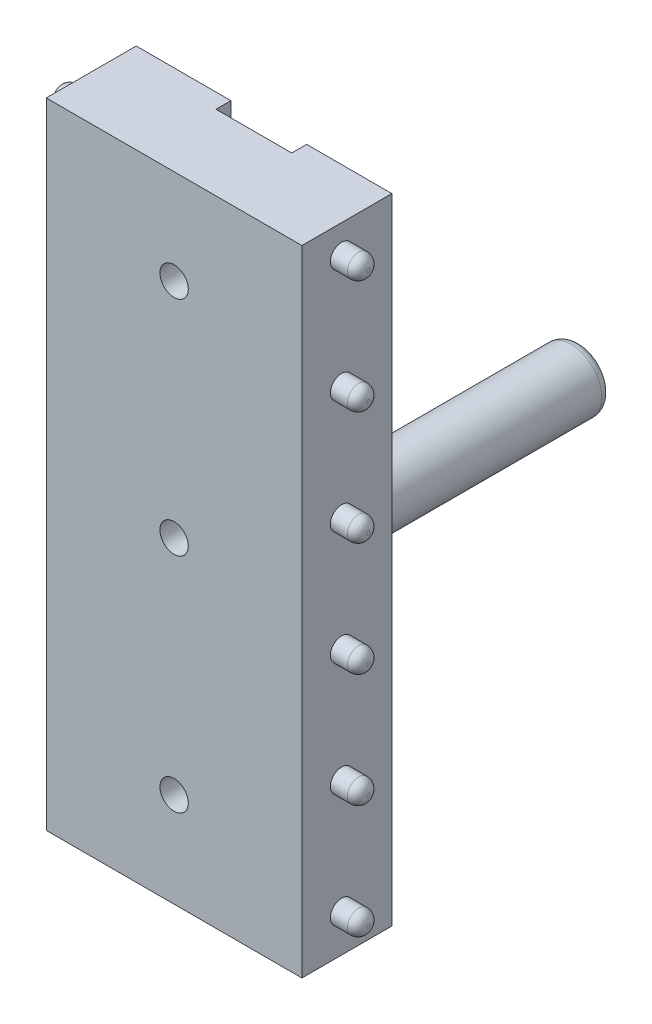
ISO-10303-21;
HEADER;
FILE_DESCRIPTION(('STEP AP214'),'2;1');
FILE_NAME('part.step','',(''),(''),'','','');
FILE_SCHEMA(('AUTOMOTIVE_DESIGN { 1 0 10303 214 1 1 1 1 }'));
ENDSEC;
DATA;
#1=APPLICATION_CONTEXT('core data for automotive mechanical design processes');
#2=APPLICATION_PROTOCOL_DEFINITION('international standard','automotive_design',2000,#1);
#3=PRODUCT_CONTEXT('',#1,'mechanical');
#4=PRODUCT('Part','Part','',(#3));
#5=PRODUCT_RELATED_PRODUCT_CATEGORY('part','',(#4));
#6=PRODUCT_DEFINITION_FORMATION('','',#4);
#7=PRODUCT_DEFINITION_CONTEXT('part definition',#1,'design');
#8=PRODUCT_DEFINITION('design','',#6,#7);
#9=PRODUCT_DEFINITION_SHAPE('','',#8);
#10=(LENGTH_UNIT() NAMED_UNIT(*) SI_UNIT(.MILLI.,.METRE.));
#11=(NAMED_UNIT(*) PLANE_ANGLE_UNIT() SI_UNIT($,.RADIAN.));
#12=(NAMED_UNIT(*) SI_UNIT($,.STERADIAN.) SOLID_ANGLE_UNIT());
#13=UNCERTAINTY_MEASURE_WITH_UNIT(LENGTH_MEASURE(1.E-05),#10,'distance_accuracy_value','');
#14=(GEOMETRIC_REPRESENTATION_CONTEXT(3) GLOBAL_UNCERTAINTY_ASSIGNED_CONTEXT((#13)) GLOBAL_UNIT_ASSIGNED_CONTEXT((#10,
#11,#12)) REPRESENTATION_CONTEXT('',''));
#15=CARTESIAN_POINT('',(0.,0.,0.));
#16=DIRECTION('',(0.,0.,1.));
#17=DIRECTION('',(1.,0.,0.));
#18=AXIS2_PLACEMENT_3D('',#15,#16,#17);
#19=CARTESIAN_POINT('',(27.,67.,0.));
#20=DIRECTION('',(-1.,0.,0.));
#21=DIRECTION('',(0.,0.,1.));
#22=AXIS2_PLACEMENT_3D('',#19,#20,#21);
#23=PLANE('',#22);
#24=CARTESIAN_POINT('',(27.,16.,-4.2000000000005));
#25=DIRECTION('',(-1.,0.,0.));
#26=DIRECTION('',(0.,0.,1.));
#27=AXIS2_PLACEMENT_3D('',#24,#25,#26);
#28=CIRCLE('',#27,1.2);
#29=CARTESIAN_POINT('',(27.,16.,-3.0000000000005));
#30=VERTEX_POINT('',#29);
#31=EDGE_CURVE('E176',#30,#30,#28,.F.);
#32=ORIENTED_EDGE('',*,*,#31,.F.);
#33=EDGE_LOOP('',(#32));
#34=FACE_BOUND('',#33,.T.);
#35=CARTESIAN_POINT('',(27.,40.,-4.20000000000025));
#36=DIRECTION('',(-1.,0.,0.));
#37=DIRECTION('',(0.,0.,1.));
#38=AXIS2_PLACEMENT_3D('',#35,#36,#37);
#39=CIRCLE('',#38,1.2);
#40=CARTESIAN_POINT('',(27.,40.,-3.00000000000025));
#41=VERTEX_POINT('',#40);
#42=EDGE_CURVE('E170',#41,#41,#39,.F.);
#43=ORIENTED_EDGE('',*,*,#42,.F.);
#44=EDGE_LOOP('',(#43));
#45=FACE_BOUND('',#44,.T.);
#46=CARTESIAN_POINT('',(27.,64.,-4.2));
#47=DIRECTION('',(-1.,0.,0.));
#48=DIRECTION('',(0.,0.,1.));
#49=AXIS2_PLACEMENT_3D('',#46,#47,#48);
#50=CIRCLE('',#49,1.2);
#51=CARTESIAN_POINT('',(27.,64.,-3.));
#52=VERTEX_POINT('',#51);
#53=EDGE_CURVE('E164',#52,#52,#50,.F.);
#54=ORIENTED_EDGE('',*,*,#53,.F.);
#55=EDGE_LOOP('',(#54));
#56=FACE_BOUND('',#55,.T.);
#57=DIRECTION('',(0.,0.,-1.));
#58=VECTOR('',#57,1.);
#59=CARTESIAN_POINT('',(27.,0.,0.));
#60=LINE('',#59,#58);
#61=CARTESIAN_POINT('',(27.,0.,0.));
#62=VERTEX_POINT('',#61);
#63=CARTESIAN_POINT('',(27.,0.,-9.5));
#64=VERTEX_POINT('',#63);
#65=EDGE_CURVE('E98',#62,#64,#60,.T.);
#66=ORIENTED_EDGE('',*,*,#65,.T.);
#67=DIRECTION('',(0.,-1.,0.));
#68=VECTOR('',#67,1.);
#69=CARTESIAN_POINT('',(27.,67.,-9.5));
#70=LINE('',#69,#68);
#71=CARTESIAN_POINT('',(27.,67.,-9.5));
#72=VERTEX_POINT('',#71);
#73=EDGE_CURVE('E158',#72,#64,#70,.T.);
#74=ORIENTED_EDGE('',*,*,#73,.F.);
#75=DIRECTION('',(0.,0.,-1.));
#76=VECTOR('',#75,1.);
#77=CARTESIAN_POINT('',(27.,67.,0.));
#78=LINE('',#77,#76);
#79=CARTESIAN_POINT('',(27.,67.,0.));
#80=VERTEX_POINT('',#79);
#81=EDGE_CURVE('E135',#80,#72,#78,.T.);
#82=ORIENTED_EDGE('',*,*,#81,.F.);
#83=DIRECTION('',(0.,-1.,0.));
#84=VECTOR('',#83,1.);
#85=CARTESIAN_POINT('',(27.,67.,0.));
#86=LINE('',#85,#84);
#87=EDGE_CURVE('E110',#80,#62,#86,.T.);
#88=ORIENTED_EDGE('',*,*,#87,.T.);
#89=EDGE_LOOP('',(#66,#74,#82,#88));
#90=FACE_BOUND('',#89,.T.);
#91=CARTESIAN_POINT('',(27.,52.,-4.20000000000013));
#92=DIRECTION('',(-1.,0.,0.));
#93=DIRECTION('',(0.,0.,1.));
#94=AXIS2_PLACEMENT_3D('',#91,#92,#93);
#95=CIRCLE('',#94,1.2);
#96=CARTESIAN_POINT('',(27.,52.,-3.00000000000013));
#97=VERTEX_POINT('',#96);
#98=EDGE_CURVE('E167',#97,#97,#95,.F.);
#99=ORIENTED_EDGE('',*,*,#98,.F.);
#100=EDGE_LOOP('',(#99));
#101=FACE_BOUND('',#100,.T.);
#102=CARTESIAN_POINT('',(27.,28.,-4.20000000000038));
#103=DIRECTION('',(-1.,0.,0.));
#104=DIRECTION('',(0.,0.,1.));
#105=AXIS2_PLACEMENT_3D('',#102,#103,#104);
#106=CIRCLE('',#105,1.2);
#107=CARTESIAN_POINT('',(27.,28.,-3.00000000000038));
#108=VERTEX_POINT('',#107);
#109=EDGE_CURVE('E173',#108,#108,#106,.F.);
#110=ORIENTED_EDGE('',*,*,#109,.F.);
#111=EDGE_LOOP('',(#110));
#112=FACE_BOUND('',#111,.T.);
#113=CARTESIAN_POINT('',(27.,4.00000000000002,-4.20000000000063));
#114=DIRECTION('',(-1.,0.,0.));
#115=DIRECTION('',(0.,0.,1.));
#116=AXIS2_PLACEMENT_3D('',#113,#114,#115);
#117=CIRCLE('',#116,1.2);
#118=CARTESIAN_POINT('',(27.,4.00000000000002,-3.00000000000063));
#119=VERTEX_POINT('',#118);
#120=EDGE_CURVE('E179',#119,#119,#117,.F.);
#121=ORIENTED_EDGE('',*,*,#120,.F.);
#122=EDGE_LOOP('',(#121));
#123=FACE_BOUND('',#122,.T.);
#124=ADVANCED_FACE('F26',(#34,#45,#56,#90,#101,#112,#123),#23,.F.);
#125=CARTESIAN_POINT('',(18.,67.,-7.92807947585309));
#126=DIRECTION('',(0.,0.,1.));
#127=DIRECTION('',(1.,0.,0.));
#128=AXIS2_PLACEMENT_3D('',#125,#126,#127);
#129=PLANE('',#128);
#130=CARTESIAN_POINT('',(13.5,33.5,-7.92807947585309));
#131=DIRECTION('',(0.,0.,1.));
#132=DIRECTION('',(1.,0.,0.));
#133=AXIS2_PLACEMENT_3D('',#130,#131,#132);
#134=CIRCLE('',#133,1.5);
#135=CARTESIAN_POINT('',(15.,33.5,-7.92807947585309));
#136=VERTEX_POINT('',#135);
#137=EDGE_CURVE('E724',#136,#136,#134,.T.);
#138=ORIENTED_EDGE('',*,*,#137,.T.);
#139=EDGE_LOOP('',(#138));
#140=FACE_BOUND('',#139,.T.);
#141=CARTESIAN_POINT('',(13.5,10.,-7.92807947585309));
#142=DIRECTION('',(0.,0.,1.));
#143=DIRECTION('',(1.,0.,0.));
#144=AXIS2_PLACEMENT_3D('',#141,#142,#143);
#145=CIRCLE('',#144,1.5);
#146=CARTESIAN_POINT('',(15.,10.,-7.92807947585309));
#147=VERTEX_POINT('',#146);
#148=EDGE_CURVE('E313',#147,#147,#145,.T.);
#149=ORIENTED_EDGE('',*,*,#148,.T.);
#150=EDGE_LOOP('',(#149));
#151=FACE_BOUND('',#150,.T.);
#152=CARTESIAN_POINT('',(13.5,57.,-7.92807947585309));
#153=DIRECTION('',(0.,0.,1.));
#154=DIRECTION('',(1.,0.,0.));
#155=AXIS2_PLACEMENT_3D('',#152,#153,#154);
#156=CIRCLE('',#155,1.5);
#157=CARTESIAN_POINT('',(15.,57.,-7.92807947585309));
#158=VERTEX_POINT('',#157);
#159=EDGE_CURVE('E312',#158,#158,#156,.T.);
#160=ORIENTED_EDGE('',*,*,#159,.T.);
#161=EDGE_LOOP('',(#160));
#162=FACE_BOUND('',#161,.T.);
#163=DIRECTION('',(-1.,0.,0.));
#164=VECTOR('',#163,1.);
#165=CARTESIAN_POINT('',(18.,0.,-7.92807947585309));
#166=LINE('',#165,#164);
#167=CARTESIAN_POINT('',(18.,0.,-7.92807947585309));
#168=VERTEX_POINT('',#167);
#169=CARTESIAN_POINT('',(10.,0.,-7.92807947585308));
#170=VERTEX_POINT('',#169);
#171=EDGE_CURVE('E126',#168,#170,#166,.T.);
#172=ORIENTED_EDGE('',*,*,#171,.T.);
#173=DIRECTION('',(0.,-1.,0.));
#174=VECTOR('',#173,1.);
#175=CARTESIAN_POINT('',(10.,67.,-7.92807947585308));
#176=LINE('',#175,#174);
#177=CARTESIAN_POINT('',(10.,67.,-7.92807947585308));
#178=VERTEX_POINT('',#177);
#179=EDGE_CURVE('E149',#178,#170,#176,.T.);
#180=ORIENTED_EDGE('',*,*,#179,.F.);
#181=DIRECTION('',(-1.,0.,0.));
#182=VECTOR('',#181,1.);
#183=CARTESIAN_POINT('',(18.,67.,-7.92807947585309));
#184=LINE('',#183,#182);
#185=CARTESIAN_POINT('',(18.,67.,-7.92807947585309));
#186=VERTEX_POINT('',#185);
#187=EDGE_CURVE('E141',#186,#178,#184,.T.);
#188=ORIENTED_EDGE('',*,*,#187,.F.);
#189=DIRECTION('',(0.,-1.,0.));
#190=VECTOR('',#189,1.);
#191=CARTESIAN_POINT('',(18.,67.,-7.92807947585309));
#192=LINE('',#191,#190);
#193=EDGE_CURVE('E152',#186,#168,#192,.T.);
#194=ORIENTED_EDGE('',*,*,#193,.T.);
#195=EDGE_LOOP('',(#172,#180,#188,#194));
#196=FACE_BOUND('',#195,.T.);
#197=CARTESIAN_POINT('',(13.5,27.,-7.92807947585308));
#198=DIRECTION('',(0.,0.,1.));
#199=DIRECTION('',(1.,0.,0.));
#200=AXIS2_PLACEMENT_3D('',#197,#198,#199);
#201=CIRCLE('',#200,3.25);
#202=CARTESIAN_POINT('',(16.75,27.,-7.92807947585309));
#203=VERTEX_POINT('',#202);
#204=EDGE_CURVE('E109',#203,#203,#201,.F.);
#205=ORIENTED_EDGE('',*,*,#204,.F.);
#206=EDGE_LOOP('',(#205));
#207=FACE_BOUND('',#206,.T.);
#208=ADVANCED_FACE('F278',(#140,#151,#162,#196,#207),#129,.F.);
#209=CARTESIAN_POINT('',(0.,67.,0.));
#210=DIRECTION('',(1.,0.,0.));
#211=DIRECTION('',(0.,0.,-1.));
#212=AXIS2_PLACEMENT_3D('',#209,#210,#211);
#213=PLANE('',#212);
#214=CARTESIAN_POINT('',(0.,4.00000000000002,-4.20000000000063));
#215=DIRECTION('',(1.,0.,0.));
#216=DIRECTION('',(0.,0.,-1.));
#217=AXIS2_PLACEMENT_3D('',#214,#215,#216);
#218=CIRCLE('',#217,1.2);
#219=CARTESIAN_POINT('',(0.,4.00000000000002,-5.40000000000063));
#220=VERTEX_POINT('',#219);
#221=EDGE_CURVE('E316',#220,#220,#218,.T.);
#222=ORIENTED_EDGE('',*,*,#221,.T.);
#223=EDGE_LOOP('',(#222));
#224=FACE_BOUND('',#223,.T.);
#225=CARTESIAN_POINT('',(0.,16.,-4.2000000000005));
#226=DIRECTION('',(1.,0.,0.));
#227=DIRECTION('',(0.,0.,-1.));
#228=AXIS2_PLACEMENT_3D('',#225,#226,#227);
#229=CIRCLE('',#228,1.2);
#230=CARTESIAN_POINT('',(0.,16.,-5.4000000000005));
#231=VERTEX_POINT('',#230);
#232=EDGE_CURVE('E324',#231,#231,#229,.T.);
#233=ORIENTED_EDGE('',*,*,#232,.T.);
#234=EDGE_LOOP('',(#233));
#235=FACE_BOUND('',#234,.T.);
#236=CARTESIAN_POINT('',(0.,28.,-4.20000000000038));
#237=DIRECTION('',(1.,0.,0.));
#238=DIRECTION('',(0.,0.,-1.));
#239=AXIS2_PLACEMENT_3D('',#236,#237,#238);
#240=CIRCLE('',#239,1.2);
#241=CARTESIAN_POINT('',(0.,28.,-5.40000000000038));
#242=VERTEX_POINT('',#241);
#243=EDGE_CURVE('E327',#242,#242,#240,.T.);
#244=ORIENTED_EDGE('',*,*,#243,.T.);
#245=EDGE_LOOP('',(#244));
#246=FACE_BOUND('',#245,.T.);
#247=CARTESIAN_POINT('',(0.,40.,-4.20000000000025));
#248=DIRECTION('',(1.,0.,0.));
#249=DIRECTION('',(0.,0.,-1.));
#250=AXIS2_PLACEMENT_3D('',#247,#248,#249);
#251=CIRCLE('',#250,1.2);
#252=CARTESIAN_POINT('',(0.,40.,-5.40000000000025));
#253=VERTEX_POINT('',#252);
#254=EDGE_CURVE('E330',#253,#253,#251,.T.);
#255=ORIENTED_EDGE('',*,*,#254,.T.);
#256=EDGE_LOOP('',(#255));
#257=FACE_BOUND('',#256,.T.);
#258=CARTESIAN_POINT('',(0.,52.,-4.20000000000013));
#259=DIRECTION('',(1.,0.,0.));
#260=DIRECTION('',(0.,0.,-1.));
#261=AXIS2_PLACEMENT_3D('',#258,#259,#260);
#262=CIRCLE('',#261,1.2);
#263=CARTESIAN_POINT('',(0.,52.,-5.40000000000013));
#264=VERTEX_POINT('',#263);
#265=EDGE_CURVE('E117',#264,#264,#262,.T.);
#266=ORIENTED_EDGE('',*,*,#265,.T.);
#267=EDGE_LOOP('',(#266));
#268=FACE_BOUND('',#267,.T.);
#269=CARTESIAN_POINT('',(0.,64.,-4.2));
#270=DIRECTION('',(1.,0.,0.));
#271=DIRECTION('',(0.,0.,-1.));
#272=AXIS2_PLACEMENT_3D('',#269,#270,#271);
#273=CIRCLE('',#272,1.2);
#274=CARTESIAN_POINT('',(0.,64.,-5.4));
#275=VERTEX_POINT('',#274);
#276=EDGE_CURVE('E114',#275,#275,#273,.T.);
#277=ORIENTED_EDGE('',*,*,#276,.T.);
#278=EDGE_LOOP('',(#277));
#279=FACE_BOUND('',#278,.T.);
#280=DIRECTION('',(0.,0.,1.));
#281=VECTOR('',#280,1.);
#282=CARTESIAN_POINT('',(0.,0.,0.));
#283=LINE('',#282,#281);
#284=CARTESIAN_POINT('',(0.,0.,-9.5));
#285=VERTEX_POINT('',#284);
#286=CARTESIAN_POINT('',(0.,0.,0.));
#287=VERTEX_POINT('',#286);
#288=EDGE_CURVE('E96',#285,#287,#283,.T.);
#289=ORIENTED_EDGE('',*,*,#288,.T.);
#290=DIRECTION('',(0.,-1.,0.));
#291=VECTOR('',#290,1.);
#292=CARTESIAN_POINT('',(0.,67.,0.));
#293=LINE('',#292,#291);
#294=CARTESIAN_POINT('',(0.,67.,0.));
#295=VERTEX_POINT('',#294);
#296=EDGE_CURVE('E104',#295,#287,#293,.T.);
#297=ORIENTED_EDGE('',*,*,#296,.F.);
#298=DIRECTION('',(0.,0.,1.));
#299=VECTOR('',#298,1.);
#300=CARTESIAN_POINT('',(0.,67.,0.));
#301=LINE('',#300,#299);
#302=CARTESIAN_POINT('',(0.,67.,-9.5));
#303=VERTEX_POINT('',#302);
#304=EDGE_CURVE('E132',#303,#295,#301,.T.);
#305=ORIENTED_EDGE('',*,*,#304,.F.);
#306=DIRECTION('',(0.,-1.,0.));
#307=VECTOR('',#306,1.);
#308=CARTESIAN_POINT('',(0.,67.,-9.5));
#309=LINE('',#308,#307);
#310=EDGE_CURVE('E113',#303,#285,#309,.T.);
#311=ORIENTED_EDGE('',*,*,#310,.T.);
#312=EDGE_LOOP('',(#289,#297,#305,#311));
#313=FACE_BOUND('',#312,.T.);
#314=ADVANCED_FACE('F28',(#224,#235,#246,#257,#268,#279,#313),#213,.F.);
#315=CARTESIAN_POINT('',(0.,67.,0.));
#316=DIRECTION('',(0.,0.,-1.));
#317=DIRECTION('',(-1.,0.,0.));
#318=AXIS2_PLACEMENT_3D('',#315,#316,#317);
#319=PLANE('',#318);
#320=CARTESIAN_POINT('',(13.5,33.5,0.));
#321=DIRECTION('',(0.,0.,1.));
#322=DIRECTION('',(1.,0.,0.));
#323=AXIS2_PLACEMENT_3D('',#320,#321,#322);
#324=CIRCLE('',#323,1.5);
#325=CARTESIAN_POINT('',(15.,33.5,0.));
#326=VERTEX_POINT('',#325);
#327=EDGE_CURVE('E304',#326,#326,#324,.T.);
#328=ORIENTED_EDGE('',*,*,#327,.F.);
#329=EDGE_LOOP('',(#328));
#330=FACE_BOUND('',#329,.T.);
#331=CARTESIAN_POINT('',(13.5,10.,0.));
#332=DIRECTION('',(0.,0.,1.));
#333=DIRECTION('',(1.,0.,0.));
#334=AXIS2_PLACEMENT_3D('',#331,#332,#333);
#335=CIRCLE('',#334,1.5);
#336=CARTESIAN_POINT('',(15.,10.,0.));
#337=VERTEX_POINT('',#336);
#338=EDGE_CURVE('E308',#337,#337,#335,.T.);
#339=ORIENTED_EDGE('',*,*,#338,.F.);
#340=EDGE_LOOP('',(#339));
#341=FACE_BOUND('',#340,.T.);
#342=CARTESIAN_POINT('',(13.5,57.,0.));
#343=DIRECTION('',(0.,0.,1.));
#344=DIRECTION('',(1.,0.,0.));
#345=AXIS2_PLACEMENT_3D('',#342,#343,#344);
#346=CIRCLE('',#345,1.5);
#347=CARTESIAN_POINT('',(15.,57.,0.));
#348=VERTEX_POINT('',#347);
#349=EDGE_CURVE('E311',#348,#348,#346,.T.);
#350=ORIENTED_EDGE('',*,*,#349,.F.);
#351=EDGE_LOOP('',(#350));
#352=FACE_BOUND('',#351,.T.);
#353=DIRECTION('',(1.,0.,0.));
#354=VECTOR('',#353,1.);
#355=CARTESIAN_POINT('',(0.,0.,0.));
#356=LINE('',#355,#354);
#357=EDGE_CURVE('E91',#287,#62,#356,.T.);
#358=ORIENTED_EDGE('',*,*,#357,.T.);
#359=ORIENTED_EDGE('',*,*,#87,.F.);
#360=DIRECTION('',(1.,0.,0.));
#361=VECTOR('',#360,1.);
#362=CARTESIAN_POINT('',(0.,67.,0.));
#363=LINE('',#362,#361);
#364=EDGE_CURVE('E106',#295,#80,#363,.T.);
#365=ORIENTED_EDGE('',*,*,#364,.F.);
#366=ORIENTED_EDGE('',*,*,#296,.T.);
#367=EDGE_LOOP('',(#358,#359,#365,#366));
#368=FACE_BOUND('',#367,.T.);
#369=ADVANCED_FACE('F105',(#330,#341,#352,#368),#319,.F.);
#370=CARTESIAN_POINT('',(18.,67.,-9.5));
#371=DIRECTION('',(0.,0.,1.));
#372=DIRECTION('',(1.,0.,0.));
#373=AXIS2_PLACEMENT_3D('',#370,#371,#372);
#374=PLANE('',#373);
#375=DIRECTION('',(-1.,0.,0.));
#376=VECTOR('',#375,1.);
#377=CARTESIAN_POINT('',(18.,0.,-9.5));
#378=LINE('',#377,#376);
#379=CARTESIAN_POINT('',(18.,0.,-9.5));
#380=VERTEX_POINT('',#379);
#381=EDGE_CURVE('E122',#64,#380,#378,.T.);
#382=ORIENTED_EDGE('',*,*,#381,.T.);
#383=DIRECTION('',(0.,-1.,0.));
#384=VECTOR('',#383,1.);
#385=CARTESIAN_POINT('',(18.,67.,-9.5));
#386=LINE('',#385,#384);
#387=CARTESIAN_POINT('',(18.,67.,-9.5));
#388=VERTEX_POINT('',#387);
#389=EDGE_CURVE('E155',#388,#380,#386,.T.);
#390=ORIENTED_EDGE('',*,*,#389,.F.);
#391=DIRECTION('',(-1.,0.,0.));
#392=VECTOR('',#391,1.);
#393=CARTESIAN_POINT('',(18.,67.,-9.5));
#394=LINE('',#393,#392);
#395=EDGE_CURVE('E137',#72,#388,#394,.T.);
#396=ORIENTED_EDGE('',*,*,#395,.F.);
#397=ORIENTED_EDGE('',*,*,#73,.T.);
#398=EDGE_LOOP('',(#382,#390,#396,#397));
#399=FACE_BOUND('',#398,.T.);
#400=ADVANCED_FACE('F290',(#399),#374,.F.);
#401=CARTESIAN_POINT('',(18.,67.,-9.5));
#402=DIRECTION('',(1.,0.,0.));
#403=DIRECTION('',(0.,0.,-1.));
#404=AXIS2_PLACEMENT_3D('',#401,#402,#403);
#405=PLANE('',#404);
#406=DIRECTION('',(0.,0.,1.));
#407=VECTOR('',#406,1.);
#408=CARTESIAN_POINT('',(18.,0.,-9.5));
#409=LINE('',#408,#407);
#410=EDGE_CURVE('E124',#380,#168,#409,.T.);
#411=ORIENTED_EDGE('',*,*,#410,.T.);
#412=ORIENTED_EDGE('',*,*,#193,.F.);
#413=DIRECTION('',(0.,0.,1.));
#414=VECTOR('',#413,1.);
#415=CARTESIAN_POINT('',(18.,67.,-9.5));
#416=LINE('',#415,#414);
#417=EDGE_CURVE('E139',#388,#186,#416,.T.);
#418=ORIENTED_EDGE('',*,*,#417,.F.);
#419=ORIENTED_EDGE('',*,*,#389,.T.);
#420=EDGE_LOOP('',(#411,#412,#418,#419));
#421=FACE_BOUND('',#420,.T.);
#422=ADVANCED_FACE('F297',(#421),#405,.F.);
#423=CARTESIAN_POINT('',(10.,67.,-7.92807947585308));
#424=DIRECTION('',(-1.,0.,0.));
#425=DIRECTION('',(0.,0.,1.));
#426=AXIS2_PLACEMENT_3D('',#423,#424,#425);
#427=PLANE('',#426);
#428=DIRECTION('',(0.,0.,-1.));
#429=VECTOR('',#428,1.);
#430=CARTESIAN_POINT('',(10.,0.,-7.92807947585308));
#431=LINE('',#430,#429);
#432=CARTESIAN_POINT('',(10.,0.,-9.5));
#433=VERTEX_POINT('',#432);
#434=EDGE_CURVE('E128',#170,#433,#431,.T.);
#435=ORIENTED_EDGE('',*,*,#434,.T.);
#436=DIRECTION('',(0.,-1.,0.));
#437=VECTOR('',#436,1.);
#438=CARTESIAN_POINT('',(10.,67.,-9.5));
#439=LINE('',#438,#437);
#440=CARTESIAN_POINT('',(10.,67.,-9.5));
#441=VERTEX_POINT('',#440);
#442=EDGE_CURVE('E146',#441,#433,#439,.T.);
#443=ORIENTED_EDGE('',*,*,#442,.F.);
#444=DIRECTION('',(0.,0.,-1.));
#445=VECTOR('',#444,1.);
#446=CARTESIAN_POINT('',(10.,67.,-7.92807947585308));
#447=LINE('',#446,#445);
#448=EDGE_CURVE('E46',#178,#441,#447,.T.);
#449=ORIENTED_EDGE('',*,*,#448,.F.);
#450=ORIENTED_EDGE('',*,*,#179,.T.);
#451=EDGE_LOOP('',(#435,#443,#449,#450));
#452=FACE_BOUND('',#451,.T.);
#453=ADVANCED_FACE('F446',(#452),#427,.F.);
#454=CARTESIAN_POINT('',(0.,67.,-9.5));
#455=DIRECTION('',(0.,0.,1.));
#456=DIRECTION('',(1.,0.,0.));
#457=AXIS2_PLACEMENT_3D('',#454,#455,#456);
#458=PLANE('',#457);
#459=DIRECTION('',(-1.,0.,0.));
#460=VECTOR('',#459,1.);
#461=CARTESIAN_POINT('',(0.,0.,-9.5));
#462=LINE('',#461,#460);
#463=EDGE_CURVE('E130',#433,#285,#462,.T.);
#464=ORIENTED_EDGE('',*,*,#463,.T.);
#465=ORIENTED_EDGE('',*,*,#310,.F.);
#466=DIRECTION('',(-1.,0.,0.));
#467=VECTOR('',#466,1.);
#468=CARTESIAN_POINT('',(0.,67.,-9.5));
#469=LINE('',#468,#467);
#470=EDGE_CURVE('E41',#441,#303,#469,.T.);
#471=ORIENTED_EDGE('',*,*,#470,.F.);
#472=ORIENTED_EDGE('',*,*,#442,.T.);
#473=EDGE_LOOP('',(#464,#465,#471,#472));
#474=FACE_BOUND('',#473,.T.);
#475=ADVANCED_FACE('F443',(#474),#458,.F.);
#476=CARTESIAN_POINT('',(0.,67.,-9.5));
#477=DIRECTION('',(0.,-1.,0.));
#478=DIRECTION('',(0.,0.,-1.));
#479=AXIS2_PLACEMENT_3D('',#476,#477,#478);
#480=PLANE('',#479);
#481=ORIENTED_EDGE('',*,*,#304,.T.);
#482=ORIENTED_EDGE('',*,*,#364,.T.);
#483=ORIENTED_EDGE('',*,*,#81,.T.);
#484=ORIENTED_EDGE('',*,*,#395,.T.);
#485=ORIENTED_EDGE('',*,*,#417,.T.);
#486=ORIENTED_EDGE('',*,*,#187,.T.);
#487=ORIENTED_EDGE('',*,*,#448,.T.);
#488=ORIENTED_EDGE('',*,*,#470,.T.);
#489=EDGE_LOOP('',(#481,#482,#483,#484,#485,#486,#487,#488));
#490=FACE_BOUND('',#489,.T.);
#491=ADVANCED_FACE('F440',(#490),#480,.F.);
#492=CARTESIAN_POINT('',(0.,0.,-9.5));
#493=DIRECTION('',(0.,-1.,0.));
#494=DIRECTION('',(0.,0.,-1.));
#495=AXIS2_PLACEMENT_3D('',#492,#493,#494);
#496=PLANE('',#495);
#497=ORIENTED_EDGE('',*,*,#288,.F.);
#498=ORIENTED_EDGE('',*,*,#463,.F.);
#499=ORIENTED_EDGE('',*,*,#434,.F.);
#500=ORIENTED_EDGE('',*,*,#171,.F.);
#501=ORIENTED_EDGE('',*,*,#410,.F.);
#502=ORIENTED_EDGE('',*,*,#381,.F.);
#503=ORIENTED_EDGE('',*,*,#65,.F.);
#504=ORIENTED_EDGE('',*,*,#357,.F.);
#505=EDGE_LOOP('',(#497,#498,#499,#500,#501,#502,#503,#504));
#506=FACE_BOUND('',#505,.T.);
#507=ADVANCED_FACE('F93',(#506),#496,.T.);
#508=CARTESIAN_POINT('',(13.5,27.,-42.9280794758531));
#509=DIRECTION('',(0.,0.,1.));
#510=DIRECTION('',(1.,0.,0.));
#511=AXIS2_PLACEMENT_3D('',#508,#509,#510);
#512=CYLINDRICAL_SURFACE('',#511,3.25);
#513=CARTESIAN_POINT('',(13.5,27.,-41.9280794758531));
#514=DIRECTION('',(0.,0.,-1.));
#515=DIRECTION('',(-1.,0.,0.));
#516=AXIS2_PLACEMENT_3D('',#513,#514,#515);
#517=CIRCLE('',#516,3.25);
#518=CARTESIAN_POINT('',(10.25,27.,-41.9280794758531));
#519=VERTEX_POINT('',#518);
#520=EDGE_CURVE('E185',#519,#519,#517,.F.);
#521=ORIENTED_EDGE('',*,*,#520,.T.);
#522=EDGE_LOOP('',(#521));
#523=FACE_BOUND('',#522,.T.);
#524=ORIENTED_EDGE('',*,*,#204,.T.);
#525=EDGE_LOOP('',(#524));
#526=FACE_BOUND('',#525,.T.);
#527=ADVANCED_FACE('F435',(#523,#526),#512,.T.);
#528=CARTESIAN_POINT('',(13.5,27.,-42.9280794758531));
#529=DIRECTION('',(0.,0.,-1.));
#530=DIRECTION('',(-1.,0.,0.));
#531=AXIS2_PLACEMENT_3D('',#528,#529,#530);
#532=PLANE('',#531);
#533=CARTESIAN_POINT('',(13.5,27.,-42.9280794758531));
#534=DIRECTION('',(0.,0.,-1.));
#535=DIRECTION('',(-1.,0.,0.));
#536=AXIS2_PLACEMENT_3D('',#533,#534,#535);
#537=CIRCLE('',#536,2.25);
#538=CARTESIAN_POINT('',(11.25,27.,-42.9280794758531));
#539=VERTEX_POINT('',#538);
#540=EDGE_CURVE('E182',#539,#539,#537,.T.);
#541=ORIENTED_EDGE('',*,*,#540,.T.);
#542=EDGE_LOOP('',(#541));
#543=FACE_BOUND('',#542,.T.);
#544=ADVANCED_FACE('F431',(#543),#532,.T.);
#545=CARTESIAN_POINT('',(29.8,64.,-4.2));
#546=DIRECTION('',(-1.,0.,0.));
#547=DIRECTION('',(0.,0.,1.));
#548=AXIS2_PLACEMENT_3D('',#545,#546,#547);
#549=CYLINDRICAL_SURFACE('',#548,1.2);
#550=CARTESIAN_POINT('',(28.8,64.,-4.2));
#551=DIRECTION('',(1.,0.,0.));
#552=DIRECTION('',(0.,0.,-1.));
#553=AXIS2_PLACEMENT_3D('',#550,#551,#552);
#554=CIRCLE('',#553,1.2);
#555=CARTESIAN_POINT('',(28.8,64.,-5.4));
#556=VERTEX_POINT('',#555);
#557=EDGE_CURVE('E221',#556,#556,#554,.F.);
#558=ORIENTED_EDGE('',*,*,#557,.T.);
#559=EDGE_LOOP('',(#558));
#560=FACE_BOUND('',#559,.T.);
#561=ORIENTED_EDGE('',*,*,#53,.T.);
#562=EDGE_LOOP('',(#561));
#563=FACE_BOUND('',#562,.T.);
#564=ADVANCED_FACE('F427',(#560,#563),#549,.T.);
#565=CARTESIAN_POINT('',(29.8,64.,-4.2));
#566=DIRECTION('',(1.,0.,0.));
#567=DIRECTION('',(0.,0.,-1.));
#568=AXIS2_PLACEMENT_3D('',#565,#566,#567);
#569=PLANE('',#568);
#570=CARTESIAN_POINT('',(29.8,64.,-4.2));
#571=DIRECTION('',(1.,0.,0.));
#572=DIRECTION('',(0.,0.,-1.));
#573=AXIS2_PLACEMENT_3D('',#570,#571,#572);
#574=CIRCLE('',#573,0.200000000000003);
#575=CARTESIAN_POINT('',(29.8,64.,-4.4));
#576=VERTEX_POINT('',#575);
#577=EDGE_CURVE('E218',#576,#576,#574,.T.);
#578=ORIENTED_EDGE('',*,*,#577,.T.);
#579=EDGE_LOOP('',(#578));
#580=FACE_BOUND('',#579,.T.);
#581=ADVANCED_FACE('F423',(#580),#569,.T.);
#582=CARTESIAN_POINT('',(29.8,52.,-4.20000000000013));
#583=DIRECTION('',(-1.,0.,0.));
#584=DIRECTION('',(0.,0.,1.));
#585=AXIS2_PLACEMENT_3D('',#582,#583,#584);
#586=CYLINDRICAL_SURFACE('',#585,1.2);
#587=CARTESIAN_POINT('',(28.8,52.,-4.20000000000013));
#588=DIRECTION('',(1.,0.,0.));
#589=DIRECTION('',(0.,0.,-1.));
#590=AXIS2_PLACEMENT_3D('',#587,#588,#589);
#591=CIRCLE('',#590,1.2);
#592=CARTESIAN_POINT('',(28.8,52.,-5.40000000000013));
#593=VERTEX_POINT('',#592);
#594=EDGE_CURVE('E215',#593,#593,#591,.F.);
#595=ORIENTED_EDGE('',*,*,#594,.T.);
#596=EDGE_LOOP('',(#595));
#597=FACE_BOUND('',#596,.T.);
#598=ORIENTED_EDGE('',*,*,#98,.T.);
#599=EDGE_LOOP('',(#598));
#600=FACE_BOUND('',#599,.T.);
#601=ADVANCED_FACE('F419',(#597,#600),#586,.T.);
#602=CARTESIAN_POINT('',(29.8,52.,-4.20000000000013));
#603=DIRECTION('',(1.,0.,0.));
#604=DIRECTION('',(0.,0.,-1.));
#605=AXIS2_PLACEMENT_3D('',#602,#603,#604);
#606=PLANE('',#605);
#607=CARTESIAN_POINT('',(29.8,52.,-4.20000000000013));
#608=DIRECTION('',(1.,0.,0.));
#609=DIRECTION('',(0.,0.,-1.));
#610=AXIS2_PLACEMENT_3D('',#607,#608,#609);
#611=CIRCLE('',#610,0.200000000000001);
#612=CARTESIAN_POINT('',(29.8,52.,-4.40000000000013));
#613=VERTEX_POINT('',#612);
#614=EDGE_CURVE('E212',#613,#613,#611,.T.);
#615=ORIENTED_EDGE('',*,*,#614,.T.);
#616=EDGE_LOOP('',(#615));
#617=FACE_BOUND('',#616,.T.);
#618=ADVANCED_FACE('F415',(#617),#606,.T.);
#619=CARTESIAN_POINT('',(29.8,40.,-4.20000000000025));
#620=DIRECTION('',(-1.,0.,0.));
#621=DIRECTION('',(0.,0.,1.));
#622=AXIS2_PLACEMENT_3D('',#619,#620,#621);
#623=CYLINDRICAL_SURFACE('',#622,1.2);
#624=CARTESIAN_POINT('',(28.8,40.,-4.20000000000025));
#625=DIRECTION('',(1.,0.,0.));
#626=DIRECTION('',(0.,0.,-1.));
#627=AXIS2_PLACEMENT_3D('',#624,#625,#626);
#628=CIRCLE('',#627,1.2);
#629=CARTESIAN_POINT('',(28.8,40.,-5.40000000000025));
#630=VERTEX_POINT('',#629);
#631=EDGE_CURVE('E209',#630,#630,#628,.F.);
#632=ORIENTED_EDGE('',*,*,#631,.T.);
#633=EDGE_LOOP('',(#632));
#634=FACE_BOUND('',#633,.T.);
#635=ORIENTED_EDGE('',*,*,#42,.T.);
#636=EDGE_LOOP('',(#635));
#637=FACE_BOUND('',#636,.T.);
#638=ADVANCED_FACE('F411',(#634,#637),#623,.T.);
#639=CARTESIAN_POINT('',(29.8,40.,-4.20000000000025));
#640=DIRECTION('',(1.,0.,0.));
#641=DIRECTION('',(0.,0.,-1.));
#642=AXIS2_PLACEMENT_3D('',#639,#640,#641);
#643=PLANE('',#642);
#644=CARTESIAN_POINT('',(29.8,40.,-4.20000000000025));
#645=DIRECTION('',(1.,0.,0.));
#646=DIRECTION('',(0.,0.,-1.));
#647=AXIS2_PLACEMENT_3D('',#644,#645,#646);
#648=CIRCLE('',#647,0.200000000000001);
#649=CARTESIAN_POINT('',(29.8,40.,-4.40000000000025));
#650=VERTEX_POINT('',#649);
#651=EDGE_CURVE('E206',#650,#650,#648,.T.);
#652=ORIENTED_EDGE('',*,*,#651,.T.);
#653=EDGE_LOOP('',(#652));
#654=FACE_BOUND('',#653,.T.);
#655=ADVANCED_FACE('F407',(#654),#643,.T.);
#656=CARTESIAN_POINT('',(29.8,28.,-4.20000000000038));
#657=DIRECTION('',(-1.,0.,0.));
#658=DIRECTION('',(0.,0.,1.));
#659=AXIS2_PLACEMENT_3D('',#656,#657,#658);
#660=CYLINDRICAL_SURFACE('',#659,1.2);
#661=CARTESIAN_POINT('',(28.8,28.,-4.20000000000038));
#662=DIRECTION('',(1.,0.,0.));
#663=DIRECTION('',(0.,0.,-1.));
#664=AXIS2_PLACEMENT_3D('',#661,#662,#663);
#665=CIRCLE('',#664,1.2);
#666=CARTESIAN_POINT('',(28.8,28.,-5.40000000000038));
#667=VERTEX_POINT('',#666);
#668=EDGE_CURVE('E203',#667,#667,#665,.F.);
#669=ORIENTED_EDGE('',*,*,#668,.T.);
#670=EDGE_LOOP('',(#669));
#671=FACE_BOUND('',#670,.T.);
#672=ORIENTED_EDGE('',*,*,#109,.T.);
#673=EDGE_LOOP('',(#672));
#674=FACE_BOUND('',#673,.T.);
#675=ADVANCED_FACE('F403',(#671,#674),#660,.T.);
#676=CARTESIAN_POINT('',(29.8,28.,-4.20000000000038));
#677=DIRECTION('',(1.,0.,0.));
#678=DIRECTION('',(0.,0.,-1.));
#679=AXIS2_PLACEMENT_3D('',#676,#677,#678);
#680=PLANE('',#679);
#681=CARTESIAN_POINT('',(29.8,28.,-4.20000000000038));
#682=DIRECTION('',(1.,0.,0.));
#683=DIRECTION('',(0.,0.,-1.));
#684=AXIS2_PLACEMENT_3D('',#681,#682,#683);
#685=CIRCLE('',#684,0.200000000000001);
#686=CARTESIAN_POINT('',(29.8,28.,-4.40000000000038));
#687=VERTEX_POINT('',#686);
#688=EDGE_CURVE('E200',#687,#687,#685,.T.);
#689=ORIENTED_EDGE('',*,*,#688,.T.);
#690=EDGE_LOOP('',(#689));
#691=FACE_BOUND('',#690,.T.);
#692=ADVANCED_FACE('F399',(#691),#680,.T.);
#693=CARTESIAN_POINT('',(29.8,16.,-4.2000000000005));
#694=DIRECTION('',(-1.,0.,0.));
#695=DIRECTION('',(0.,0.,1.));
#696=AXIS2_PLACEMENT_3D('',#693,#694,#695);
#697=CYLINDRICAL_SURFACE('',#696,1.2);
#698=CARTESIAN_POINT('',(28.8,16.,-4.2000000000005));
#699=DIRECTION('',(1.,0.,0.));
#700=DIRECTION('',(0.,0.,-1.));
#701=AXIS2_PLACEMENT_3D('',#698,#699,#700);
#702=CIRCLE('',#701,1.2);
#703=CARTESIAN_POINT('',(28.8,16.,-5.4000000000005));
#704=VERTEX_POINT('',#703);
#705=EDGE_CURVE('E197',#704,#704,#702,.F.);
#706=ORIENTED_EDGE('',*,*,#705,.T.);
#707=EDGE_LOOP('',(#706));
#708=FACE_BOUND('',#707,.T.);
#709=ORIENTED_EDGE('',*,*,#31,.T.);
#710=EDGE_LOOP('',(#709));
#711=FACE_BOUND('',#710,.T.);
#712=ADVANCED_FACE('F395',(#708,#711),#697,.T.);
#713=CARTESIAN_POINT('',(29.8,16.,-4.2000000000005));
#714=DIRECTION('',(1.,0.,0.));
#715=DIRECTION('',(0.,0.,-1.));
#716=AXIS2_PLACEMENT_3D('',#713,#714,#715);
#717=PLANE('',#716);
#718=CARTESIAN_POINT('',(29.8,16.,-4.2000000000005));
#719=DIRECTION('',(1.,0.,0.));
#720=DIRECTION('',(0.,0.,-1.));
#721=AXIS2_PLACEMENT_3D('',#718,#719,#720);
#722=CIRCLE('',#721,0.200000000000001);
#723=CARTESIAN_POINT('',(29.8,16.,-4.4000000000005));
#724=VERTEX_POINT('',#723);
#725=EDGE_CURVE('E194',#724,#724,#722,.T.);
#726=ORIENTED_EDGE('',*,*,#725,.T.);
#727=EDGE_LOOP('',(#726));
#728=FACE_BOUND('',#727,.T.);
#729=ADVANCED_FACE('F391',(#728),#717,.T.);
#730=CARTESIAN_POINT('',(29.8,4.00000000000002,-4.20000000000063));
#731=DIRECTION('',(-1.,0.,0.));
#732=DIRECTION('',(0.,0.,1.));
#733=AXIS2_PLACEMENT_3D('',#730,#731,#732);
#734=CYLINDRICAL_SURFACE('',#733,1.2);
#735=CARTESIAN_POINT('',(28.8,4.00000000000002,-4.20000000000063));
#736=DIRECTION('',(1.,0.,0.));
#737=DIRECTION('',(0.,0.,-1.));
#738=AXIS2_PLACEMENT_3D('',#735,#736,#737);
#739=CIRCLE('',#738,1.2);
#740=CARTESIAN_POINT('',(28.8,4.00000000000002,-5.40000000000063));
#741=VERTEX_POINT('',#740);
#742=EDGE_CURVE('E191',#741,#741,#739,.F.);
#743=ORIENTED_EDGE('',*,*,#742,.T.);
#744=EDGE_LOOP('',(#743));
#745=FACE_BOUND('',#744,.T.);
#746=ORIENTED_EDGE('',*,*,#120,.T.);
#747=EDGE_LOOP('',(#746));
#748=FACE_BOUND('',#747,.T.);
#749=ADVANCED_FACE('F387',(#745,#748),#734,.T.);
#750=CARTESIAN_POINT('',(29.8,4.00000000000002,-4.20000000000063));
#751=DIRECTION('',(1.,0.,0.));
#752=DIRECTION('',(0.,0.,-1.));
#753=AXIS2_PLACEMENT_3D('',#750,#751,#752);
#754=PLANE('',#753);
#755=CARTESIAN_POINT('',(29.8,4.00000000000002,-4.20000000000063));
#756=DIRECTION('',(1.,0.,0.));
#757=DIRECTION('',(0.,0.,-1.));
#758=AXIS2_PLACEMENT_3D('',#755,#756,#757);
#759=CIRCLE('',#758,0.200000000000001);
#760=CARTESIAN_POINT('',(29.8,4.00000000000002,-4.40000000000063));
#761=VERTEX_POINT('',#760);
#762=EDGE_CURVE('E188',#761,#761,#759,.T.);
#763=ORIENTED_EDGE('',*,*,#762,.T.);
#764=EDGE_LOOP('',(#763));
#765=FACE_BOUND('',#764,.T.);
#766=ADVANCED_FACE('F383',(#765),#754,.T.);
#767=CARTESIAN_POINT('',(13.5,27.,-41.9280794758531));
#768=DIRECTION('',(0.,0.,-1.));
#769=DIRECTION('',(-1.,0.,0.));
#770=AXIS2_PLACEMENT_3D('',#767,#768,#769);
#771=TOROIDAL_SURFACE('',#770,2.25,1.);
#772=ORIENTED_EDGE('',*,*,#520,.F.);
#773=EDGE_LOOP('',(#772));
#774=FACE_BOUND('',#773,.T.);
#775=ORIENTED_EDGE('',*,*,#540,.F.);
#776=EDGE_LOOP('',(#775));
#777=FACE_BOUND('',#776,.T.);
#778=ADVANCED_FACE('F379',(#774,#777),#771,.T.);
#779=CARTESIAN_POINT('',(28.8,4.00000000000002,-4.20000000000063));
#780=DIRECTION('',(1.,0.,0.));
#781=DIRECTION('',(0.,0.,-1.));
#782=AXIS2_PLACEMENT_3D('',#779,#780,#781);
#783=DEGENERATE_TOROIDAL_SURFACE('',#782,0.200000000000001,1.,.T.);
#784=ORIENTED_EDGE('',*,*,#742,.F.);
#785=EDGE_LOOP('',(#784));
#786=FACE_BOUND('',#785,.T.);
#787=ORIENTED_EDGE('',*,*,#762,.F.);
#788=EDGE_LOOP('',(#787));
#789=FACE_BOUND('',#788,.T.);
#790=ADVANCED_FACE('F375',(#786,#789),#783,.T.);
#791=CARTESIAN_POINT('',(28.8,16.,-4.2000000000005));
#792=DIRECTION('',(1.,0.,0.));
#793=DIRECTION('',(0.,0.,-1.));
#794=AXIS2_PLACEMENT_3D('',#791,#792,#793);
#795=DEGENERATE_TOROIDAL_SURFACE('',#794,0.200000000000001,1.,.T.);
#796=ORIENTED_EDGE('',*,*,#705,.F.);
#797=EDGE_LOOP('',(#796));
#798=FACE_BOUND('',#797,.T.);
#799=ORIENTED_EDGE('',*,*,#725,.F.);
#800=EDGE_LOOP('',(#799));
#801=FACE_BOUND('',#800,.T.);
#802=ADVANCED_FACE('F371',(#798,#801),#795,.T.);
#803=CARTESIAN_POINT('',(28.8,28.,-4.20000000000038));
#804=DIRECTION('',(1.,0.,0.));
#805=DIRECTION('',(0.,0.,-1.));
#806=AXIS2_PLACEMENT_3D('',#803,#804,#805);
#807=DEGENERATE_TOROIDAL_SURFACE('',#806,0.200000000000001,1.,.T.);
#808=ORIENTED_EDGE('',*,*,#668,.F.);
#809=EDGE_LOOP('',(#808));
#810=FACE_BOUND('',#809,.T.);
#811=ORIENTED_EDGE('',*,*,#688,.F.);
#812=EDGE_LOOP('',(#811));
#813=FACE_BOUND('',#812,.T.);
#814=ADVANCED_FACE('F367',(#810,#813),#807,.T.);
#815=CARTESIAN_POINT('',(28.8,40.,-4.20000000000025));
#816=DIRECTION('',(1.,0.,0.));
#817=DIRECTION('',(0.,0.,-1.));
#818=AXIS2_PLACEMENT_3D('',#815,#816,#817);
#819=DEGENERATE_TOROIDAL_SURFACE('',#818,0.200000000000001,1.,.T.);
#820=ORIENTED_EDGE('',*,*,#631,.F.);
#821=EDGE_LOOP('',(#820));
#822=FACE_BOUND('',#821,.T.);
#823=ORIENTED_EDGE('',*,*,#651,.F.);
#824=EDGE_LOOP('',(#823));
#825=FACE_BOUND('',#824,.T.);
#826=ADVANCED_FACE('F363',(#822,#825),#819,.T.);
#827=CARTESIAN_POINT('',(28.8,52.,-4.20000000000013));
#828=DIRECTION('',(1.,0.,0.));
#829=DIRECTION('',(0.,0.,-1.));
#830=AXIS2_PLACEMENT_3D('',#827,#828,#829);
#831=DEGENERATE_TOROIDAL_SURFACE('',#830,0.200000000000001,1.,.T.);
#832=ORIENTED_EDGE('',*,*,#594,.F.);
#833=EDGE_LOOP('',(#832));
#834=FACE_BOUND('',#833,.T.);
#835=ORIENTED_EDGE('',*,*,#614,.F.);
#836=EDGE_LOOP('',(#835));
#837=FACE_BOUND('',#836,.T.);
#838=ADVANCED_FACE('F359',(#834,#837),#831,.T.);
#839=CARTESIAN_POINT('',(28.8,64.,-4.2));
#840=DIRECTION('',(1.,0.,0.));
#841=DIRECTION('',(0.,0.,-1.));
#842=AXIS2_PLACEMENT_3D('',#839,#840,#841);
#843=DEGENERATE_TOROIDAL_SURFACE('',#842,0.200000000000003,1.,.T.);
#844=ORIENTED_EDGE('',*,*,#557,.F.);
#845=EDGE_LOOP('',(#844));
#846=FACE_BOUND('',#845,.T.);
#847=ORIENTED_EDGE('',*,*,#577,.F.);
#848=EDGE_LOOP('',(#847));
#849=FACE_BOUND('',#848,.T.);
#850=ADVANCED_FACE('F356',(#846,#849),#843,.T.);
#851=CARTESIAN_POINT('',(-2.8,64.,-4.2));
#852=DIRECTION('',(1.,0.,0.));
#853=DIRECTION('',(0.,0.,-1.));
#854=AXIS2_PLACEMENT_3D('',#851,#852,#853);
#855=CYLINDRICAL_SURFACE('',#854,1.2);
#856=CARTESIAN_POINT('',(-1.8,64.,-4.2));
#857=DIRECTION('',(-1.,0.,0.));
#858=DIRECTION('',(0.,0.,1.));
#859=AXIS2_PLACEMENT_3D('',#856,#857,#858);
#860=CIRCLE('',#859,1.2);
#861=CARTESIAN_POINT('',(-1.8,64.,-3.));
#862=VERTEX_POINT('',#861);
#863=EDGE_CURVE('E34',#862,#862,#860,.F.);
#864=ORIENTED_EDGE('',*,*,#863,.T.);
#865=EDGE_LOOP('',(#864));
#866=FACE_BOUND('',#865,.T.);
#867=ORIENTED_EDGE('',*,*,#276,.F.);
#868=EDGE_LOOP('',(#867));
#869=FACE_BOUND('',#868,.T.);
#870=ADVANCED_FACE('F256',(#866,#869),#855,.T.);
#871=CARTESIAN_POINT('',(-2.8,64.,-4.2));
#872=DIRECTION('',(-1.,0.,0.));
#873=DIRECTION('',(0.,0.,-1.));
#874=AXIS2_PLACEMENT_3D('',#871,#872,#873);
#875=PLANE('',#874);
#876=CARTESIAN_POINT('',(-2.8,64.,-4.2));
#877=DIRECTION('',(-1.,0.,0.));
#878=DIRECTION('',(0.,0.,1.));
#879=AXIS2_PLACEMENT_3D('',#876,#877,#878);
#880=CIRCLE('',#879,0.200000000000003);
#881=CARTESIAN_POINT('',(-2.8,64.,-4.));
#882=VERTEX_POINT('',#881);
#883=EDGE_CURVE('E11',#882,#882,#880,.T.);
#884=ORIENTED_EDGE('',*,*,#883,.T.);
#885=EDGE_LOOP('',(#884));
#886=FACE_BOUND('',#885,.T.);
#887=ADVANCED_FACE('F340',(#886),#875,.T.);
#888=CARTESIAN_POINT('',(-2.8,52.,-4.20000000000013));
#889=DIRECTION('',(1.,0.,0.));
#890=DIRECTION('',(0.,0.,-1.));
#891=AXIS2_PLACEMENT_3D('',#888,#889,#890);
#892=CYLINDRICAL_SURFACE('',#891,1.2);
#893=CARTESIAN_POINT('',(-1.8,52.,-4.20000000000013));
#894=DIRECTION('',(-1.,0.,0.));
#895=DIRECTION('',(0.,0.,1.));
#896=AXIS2_PLACEMENT_3D('',#893,#894,#895);
#897=CIRCLE('',#896,1.2);
#898=CARTESIAN_POINT('',(-1.8,52.,-3.00000000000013));
#899=VERTEX_POINT('',#898);
#900=EDGE_CURVE('E248',#899,#899,#897,.F.);
#901=ORIENTED_EDGE('',*,*,#900,.T.);
#902=EDGE_LOOP('',(#901));
#903=FACE_BOUND('',#902,.T.);
#904=ORIENTED_EDGE('',*,*,#265,.F.);
#905=EDGE_LOOP('',(#904));
#906=FACE_BOUND('',#905,.T.);
#907=ADVANCED_FACE('F337',(#903,#906),#892,.T.);
#908=CARTESIAN_POINT('',(-2.8,52.,-4.20000000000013));
#909=DIRECTION('',(-1.,0.,0.));
#910=DIRECTION('',(0.,0.,-1.));
#911=AXIS2_PLACEMENT_3D('',#908,#909,#910);
#912=PLANE('',#911);
#913=CARTESIAN_POINT('',(-2.8,52.,-4.20000000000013));
#914=DIRECTION('',(-1.,0.,0.));
#915=DIRECTION('',(0.,0.,1.));
#916=AXIS2_PLACEMENT_3D('',#913,#914,#915);
#917=CIRCLE('',#916,0.200000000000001);
#918=CARTESIAN_POINT('',(-2.8,52.,-4.00000000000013));
#919=VERTEX_POINT('',#918);
#920=EDGE_CURVE('E251',#919,#919,#917,.T.);
#921=ORIENTED_EDGE('',*,*,#920,.T.);
#922=EDGE_LOOP('',(#921));
#923=FACE_BOUND('',#922,.T.);
#924=ADVANCED_FACE('F339',(#923),#912,.T.);
#925=CARTESIAN_POINT('',(-2.8,40.,-4.20000000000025));
#926=DIRECTION('',(1.,0.,0.));
#927=DIRECTION('',(0.,0.,-1.));
#928=AXIS2_PLACEMENT_3D('',#925,#926,#927);
#929=CYLINDRICAL_SURFACE('',#928,1.2);
#930=CARTESIAN_POINT('',(-1.8,40.,-4.20000000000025));
#931=DIRECTION('',(-1.,0.,0.));
#932=DIRECTION('',(0.,0.,1.));
#933=AXIS2_PLACEMENT_3D('',#930,#931,#932);
#934=CIRCLE('',#933,1.2);
#935=CARTESIAN_POINT('',(-1.8,40.,-3.00000000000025));
#936=VERTEX_POINT('',#935);
#937=EDGE_CURVE('E242',#936,#936,#934,.F.);
#938=ORIENTED_EDGE('',*,*,#937,.T.);
#939=EDGE_LOOP('',(#938));
#940=FACE_BOUND('',#939,.T.);
#941=ORIENTED_EDGE('',*,*,#254,.F.);
#942=EDGE_LOOP('',(#941));
#943=FACE_BOUND('',#942,.T.);
#944=ADVANCED_FACE('F347',(#940,#943),#929,.T.);
#945=CARTESIAN_POINT('',(-2.8,40.,-4.20000000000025));
#946=DIRECTION('',(-1.,0.,0.));
#947=DIRECTION('',(0.,0.,-1.));
#948=AXIS2_PLACEMENT_3D('',#945,#946,#947);
#949=PLANE('',#948);
#950=CARTESIAN_POINT('',(-2.8,40.,-4.20000000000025));
#951=DIRECTION('',(-1.,0.,0.));
#952=DIRECTION('',(0.,0.,1.));
#953=AXIS2_PLACEMENT_3D('',#950,#951,#952);
#954=CIRCLE('',#953,0.200000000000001);
#955=CARTESIAN_POINT('',(-2.8,40.,-4.00000000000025));
#956=VERTEX_POINT('',#955);
#957=EDGE_CURVE('E245',#956,#956,#954,.T.);
#958=ORIENTED_EDGE('',*,*,#957,.T.);
#959=EDGE_LOOP('',(#958));
#960=FACE_BOUND('',#959,.T.);
#961=ADVANCED_FACE('F608',(#960),#949,.T.);
#962=CARTESIAN_POINT('',(-2.8,28.,-4.20000000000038));
#963=DIRECTION('',(1.,0.,0.));
#964=DIRECTION('',(0.,0.,-1.));
#965=AXIS2_PLACEMENT_3D('',#962,#963,#964);
#966=CYLINDRICAL_SURFACE('',#965,1.2);
#967=CARTESIAN_POINT('',(-1.8,28.,-4.20000000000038));
#968=DIRECTION('',(-1.,0.,0.));
#969=DIRECTION('',(0.,0.,1.));
#970=AXIS2_PLACEMENT_3D('',#967,#968,#969);
#971=CIRCLE('',#970,1.2);
#972=CARTESIAN_POINT('',(-1.8,28.,-3.00000000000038));
#973=VERTEX_POINT('',#972);
#974=EDGE_CURVE('E236',#973,#973,#971,.F.);
#975=ORIENTED_EDGE('',*,*,#974,.T.);
#976=EDGE_LOOP('',(#975));
#977=FACE_BOUND('',#976,.T.);
#978=ORIENTED_EDGE('',*,*,#243,.F.);
#979=EDGE_LOOP('',(#978));
#980=FACE_BOUND('',#979,.T.);
#981=ADVANCED_FACE('F615',(#977,#980),#966,.T.);
#982=CARTESIAN_POINT('',(-2.8,28.,-4.20000000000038));
#983=DIRECTION('',(-1.,0.,0.));
#984=DIRECTION('',(0.,0.,-1.));
#985=AXIS2_PLACEMENT_3D('',#982,#983,#984);
#986=PLANE('',#985);
#987=CARTESIAN_POINT('',(-2.8,28.,-4.20000000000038));
#988=DIRECTION('',(-1.,0.,0.));
#989=DIRECTION('',(0.,0.,1.));
#990=AXIS2_PLACEMENT_3D('',#987,#988,#989);
#991=CIRCLE('',#990,0.200000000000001);
#992=CARTESIAN_POINT('',(-2.8,28.,-4.00000000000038));
#993=VERTEX_POINT('',#992);
#994=EDGE_CURVE('E239',#993,#993,#991,.T.);
#995=ORIENTED_EDGE('',*,*,#994,.T.);
#996=EDGE_LOOP('',(#995));
#997=FACE_BOUND('',#996,.T.);
#998=ADVANCED_FACE('F623',(#997),#986,.T.);
#999=CARTESIAN_POINT('',(-2.8,16.,-4.2000000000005));
#1000=DIRECTION('',(1.,0.,0.));
#1001=DIRECTION('',(0.,0.,-1.));
#1002=AXIS2_PLACEMENT_3D('',#999,#1000,#1001);
#1003=CYLINDRICAL_SURFACE('',#1002,1.2);
#1004=CARTESIAN_POINT('',(-1.8,16.,-4.2000000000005));
#1005=DIRECTION('',(-1.,0.,0.));
#1006=DIRECTION('',(0.,0.,1.));
#1007=AXIS2_PLACEMENT_3D('',#1004,#1005,#1006);
#1008=CIRCLE('',#1007,1.2);
#1009=CARTESIAN_POINT('',(-1.8,16.,-3.0000000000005));
#1010=VERTEX_POINT('',#1009);
#1011=EDGE_CURVE('E230',#1010,#1010,#1008,.F.);
#1012=ORIENTED_EDGE('',*,*,#1011,.T.);
#1013=EDGE_LOOP('',(#1012));
#1014=FACE_BOUND('',#1013,.T.);
#1015=ORIENTED_EDGE('',*,*,#232,.F.);
#1016=EDGE_LOOP('',(#1015));
#1017=FACE_BOUND('',#1016,.T.);
#1018=ADVANCED_FACE('F631',(#1014,#1017),#1003,.T.);
#1019=CARTESIAN_POINT('',(-2.8,16.,-4.2000000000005));
#1020=DIRECTION('',(-1.,0.,0.));
#1021=DIRECTION('',(0.,0.,-1.));
#1022=AXIS2_PLACEMENT_3D('',#1019,#1020,#1021);
#1023=PLANE('',#1022);
#1024=CARTESIAN_POINT('',(-2.8,16.,-4.2000000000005));
#1025=DIRECTION('',(-1.,0.,0.));
#1026=DIRECTION('',(0.,0.,1.));
#1027=AXIS2_PLACEMENT_3D('',#1024,#1025,#1026);
#1028=CIRCLE('',#1027,0.200000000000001);
#1029=CARTESIAN_POINT('',(-2.8,16.,-4.0000000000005));
#1030=VERTEX_POINT('',#1029);
#1031=EDGE_CURVE('E233',#1030,#1030,#1028,.T.);
#1032=ORIENTED_EDGE('',*,*,#1031,.T.);
#1033=EDGE_LOOP('',(#1032));
#1034=FACE_BOUND('',#1033,.T.);
#1035=ADVANCED_FACE('F639',(#1034),#1023,.T.);
#1036=CARTESIAN_POINT('',(-2.8,4.00000000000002,-4.20000000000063));
#1037=DIRECTION('',(1.,0.,0.));
#1038=DIRECTION('',(0.,0.,-1.));
#1039=AXIS2_PLACEMENT_3D('',#1036,#1037,#1038);
#1040=CYLINDRICAL_SURFACE('',#1039,1.2);
#1041=CARTESIAN_POINT('',(-1.8,4.00000000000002,-4.20000000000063));
#1042=DIRECTION('',(-1.,0.,0.));
#1043=DIRECTION('',(0.,0.,1.));
#1044=AXIS2_PLACEMENT_3D('',#1041,#1042,#1043);
#1045=CIRCLE('',#1044,1.2);
#1046=CARTESIAN_POINT('',(-1.8,4.00000000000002,-3.00000000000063));
#1047=VERTEX_POINT('',#1046);
#1048=EDGE_CURVE('E224',#1047,#1047,#1045,.F.);
#1049=ORIENTED_EDGE('',*,*,#1048,.T.);
#1050=EDGE_LOOP('',(#1049));
#1051=FACE_BOUND('',#1050,.T.);
#1052=ORIENTED_EDGE('',*,*,#221,.F.);
#1053=EDGE_LOOP('',(#1052));
#1054=FACE_BOUND('',#1053,.T.);
#1055=ADVANCED_FACE('F647',(#1051,#1054),#1040,.T.);
#1056=CARTESIAN_POINT('',(-2.8,4.00000000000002,-4.20000000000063));
#1057=DIRECTION('',(-1.,0.,0.));
#1058=DIRECTION('',(0.,0.,-1.));
#1059=AXIS2_PLACEMENT_3D('',#1056,#1057,#1058);
#1060=PLANE('',#1059);
#1061=CARTESIAN_POINT('',(-2.8,4.00000000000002,-4.20000000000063));
#1062=DIRECTION('',(-1.,0.,0.));
#1063=DIRECTION('',(0.,0.,1.));
#1064=AXIS2_PLACEMENT_3D('',#1061,#1062,#1063);
#1065=CIRCLE('',#1064,0.200000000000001);
#1066=CARTESIAN_POINT('',(-2.8,4.00000000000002,-4.00000000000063));
#1067=VERTEX_POINT('',#1066);
#1068=EDGE_CURVE('E227',#1067,#1067,#1065,.T.);
#1069=ORIENTED_EDGE('',*,*,#1068,.T.);
#1070=EDGE_LOOP('',(#1069));
#1071=FACE_BOUND('',#1070,.T.);
#1072=ADVANCED_FACE('F655',(#1071),#1060,.T.);
#1073=CARTESIAN_POINT('',(-1.8,4.00000000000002,-4.20000000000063));
#1074=DIRECTION('',(-1.,0.,0.));
#1075=DIRECTION('',(0.,0.,1.));
#1076=AXIS2_PLACEMENT_3D('',#1073,#1074,#1075);
#1077=DEGENERATE_TOROIDAL_SURFACE('',#1076,0.200000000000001,1.,.T.);
#1078=ORIENTED_EDGE('',*,*,#1068,.F.);
#1079=EDGE_LOOP('',(#1078));
#1080=FACE_BOUND('',#1079,.T.);
#1081=ORIENTED_EDGE('',*,*,#1048,.F.);
#1082=EDGE_LOOP('',(#1081));
#1083=FACE_BOUND('',#1082,.T.);
#1084=ADVANCED_FACE('F663',(#1080,#1083),#1077,.T.);
#1085=CARTESIAN_POINT('',(-1.8,16.,-4.2000000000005));
#1086=DIRECTION('',(-1.,0.,0.));
#1087=DIRECTION('',(0.,0.,1.));
#1088=AXIS2_PLACEMENT_3D('',#1085,#1086,#1087);
#1089=DEGENERATE_TOROIDAL_SURFACE('',#1088,0.200000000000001,1.,.T.);
#1090=ORIENTED_EDGE('',*,*,#1031,.F.);
#1091=EDGE_LOOP('',(#1090));
#1092=FACE_BOUND('',#1091,.T.);
#1093=ORIENTED_EDGE('',*,*,#1011,.F.);
#1094=EDGE_LOOP('',(#1093));
#1095=FACE_BOUND('',#1094,.T.);
#1096=ADVANCED_FACE('F671',(#1092,#1095),#1089,.T.);
#1097=CARTESIAN_POINT('',(-1.8,28.,-4.20000000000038));
#1098=DIRECTION('',(-1.,0.,0.));
#1099=DIRECTION('',(0.,0.,1.));
#1100=AXIS2_PLACEMENT_3D('',#1097,#1098,#1099);
#1101=DEGENERATE_TOROIDAL_SURFACE('',#1100,0.200000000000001,1.,.T.);
#1102=ORIENTED_EDGE('',*,*,#994,.F.);
#1103=EDGE_LOOP('',(#1102));
#1104=FACE_BOUND('',#1103,.T.);
#1105=ORIENTED_EDGE('',*,*,#974,.F.);
#1106=EDGE_LOOP('',(#1105));
#1107=FACE_BOUND('',#1106,.T.);
#1108=ADVANCED_FACE('F679',(#1104,#1107),#1101,.T.);
#1109=CARTESIAN_POINT('',(-1.8,40.,-4.20000000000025));
#1110=DIRECTION('',(-1.,0.,0.));
#1111=DIRECTION('',(0.,0.,1.));
#1112=AXIS2_PLACEMENT_3D('',#1109,#1110,#1111);
#1113=DEGENERATE_TOROIDAL_SURFACE('',#1112,0.200000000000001,1.,.T.);
#1114=ORIENTED_EDGE('',*,*,#957,.F.);
#1115=EDGE_LOOP('',(#1114));
#1116=FACE_BOUND('',#1115,.T.);
#1117=ORIENTED_EDGE('',*,*,#937,.F.);
#1118=EDGE_LOOP('',(#1117));
#1119=FACE_BOUND('',#1118,.T.);
#1120=ADVANCED_FACE('F273',(#1116,#1119),#1113,.T.);
#1121=CARTESIAN_POINT('',(-1.8,52.,-4.20000000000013));
#1122=DIRECTION('',(-1.,0.,0.));
#1123=DIRECTION('',(0.,0.,1.));
#1124=AXIS2_PLACEMENT_3D('',#1121,#1122,#1123);
#1125=DEGENERATE_TOROIDAL_SURFACE('',#1124,0.200000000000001,1.,.T.);
#1126=ORIENTED_EDGE('',*,*,#920,.F.);
#1127=EDGE_LOOP('',(#1126));
#1128=FACE_BOUND('',#1127,.T.);
#1129=ORIENTED_EDGE('',*,*,#900,.F.);
#1130=EDGE_LOOP('',(#1129));
#1131=FACE_BOUND('',#1130,.T.);
#1132=ADVANCED_FACE('F262',(#1128,#1131),#1125,.T.);
#1133=CARTESIAN_POINT('',(-1.8,64.,-4.2));
#1134=DIRECTION('',(-1.,0.,0.));
#1135=DIRECTION('',(0.,0.,1.));
#1136=AXIS2_PLACEMENT_3D('',#1133,#1134,#1135);
#1137=DEGENERATE_TOROIDAL_SURFACE('',#1136,0.200000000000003,1.,.T.);
#1138=ORIENTED_EDGE('',*,*,#883,.F.);
#1139=EDGE_LOOP('',(#1138));
#1140=FACE_BOUND('',#1139,.T.);
#1141=ORIENTED_EDGE('',*,*,#863,.F.);
#1142=EDGE_LOOP('',(#1141));
#1143=FACE_BOUND('',#1142,.T.);
#1144=ADVANCED_FACE('F259',(#1140,#1143),#1137,.T.);
#1145=CARTESIAN_POINT('',(13.5,57.,-10.));
#1146=DIRECTION('',(0.,0.,1.));
#1147=DIRECTION('',(1.,0.,0.));
#1148=AXIS2_PLACEMENT_3D('',#1145,#1146,#1147);
#1149=CYLINDRICAL_SURFACE('',#1148,1.5);
#1150=ORIENTED_EDGE('',*,*,#349,.T.);
#1151=EDGE_LOOP('',(#1150));
#1152=FACE_BOUND('',#1151,.T.);
#1153=ORIENTED_EDGE('',*,*,#159,.F.);
#1154=EDGE_LOOP('',(#1153));
#1155=FACE_BOUND('',#1154,.T.);
#1156=ADVANCED_FACE('F261',(#1152,#1155),#1149,.F.);
#1157=CARTESIAN_POINT('',(13.5,10.,-10.));
#1158=DIRECTION('',(0.,0.,1.));
#1159=DIRECTION('',(1.,0.,0.));
#1160=AXIS2_PLACEMENT_3D('',#1157,#1158,#1159);
#1161=CYLINDRICAL_SURFACE('',#1160,1.5);
#1162=ORIENTED_EDGE('',*,*,#338,.T.);
#1163=EDGE_LOOP('',(#1162));
#1164=FACE_BOUND('',#1163,.T.);
#1165=ORIENTED_EDGE('',*,*,#148,.F.);
#1166=EDGE_LOOP('',(#1165));
#1167=FACE_BOUND('',#1166,.T.);
#1168=ADVANCED_FACE('F270',(#1164,#1167),#1161,.F.);
#1169=CARTESIAN_POINT('',(13.5,33.5,-10.));
#1170=DIRECTION('',(0.,0.,1.));
#1171=DIRECTION('',(1.,0.,0.));
#1172=AXIS2_PLACEMENT_3D('',#1169,#1170,#1171);
#1173=CYLINDRICAL_SURFACE('',#1172,1.5);
#1174=ORIENTED_EDGE('',*,*,#327,.T.);
#1175=EDGE_LOOP('',(#1174));
#1176=FACE_BOUND('',#1175,.T.);
#1177=ORIENTED_EDGE('',*,*,#137,.F.);
#1178=EDGE_LOOP('',(#1177));
#1179=FACE_BOUND('',#1178,.T.);
#1180=ADVANCED_FACE('F711',(#1176,#1179),#1173,.F.);
#1181=CLOSED_SHELL('',(#124,#208,#314,#369,#400,#422,#453,#475,#491,#507,#527,#544,#564,#581,
#601,#618,#638,#655,#675,#692,#712,#729,#749,#766,#778,#790,#802,#814,#826,#838,#850,#870,#887,
#907,#924,#944,#961,#981,#998,#1018,#1035,#1055,#1072,#1084,#1096,#1108,#1120,#1132,#1144,#1156,
#1168,#1180));
#1182=MANIFOLD_SOLID_BREP('B2',#1181);
#1183=ADVANCED_BREP_SHAPE_REPRESENTATION('',(#18,#1182),#14);
#1184=SHAPE_DEFINITION_REPRESENTATION(#9,#1183);
ENDSEC;
END-ISO-10303-21;
